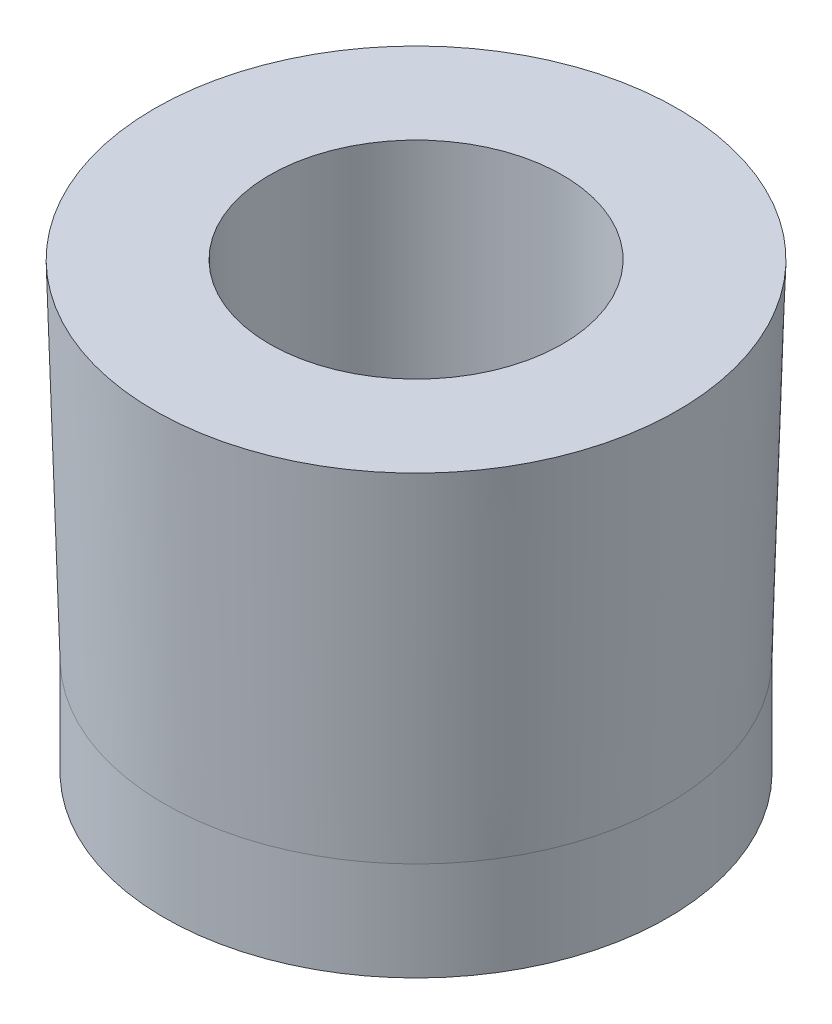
from build123d import *

# Parameters (mm, degrees)
F_4_40_TAPPED_HOLE1_D = 2.2606


with BuildPart() as part:
    # Sketch1 → Revolve1 (revolve)
    with BuildSketch(Plane.XY, mode=Mode.PRIVATE) as revolve1_sk:
        Polygon((0, -0.889), (2.0193, -0.889), (1.9431, -3.556), (1.9431, -4.318), (0, -4.318), align=None)
    revolve(revolve1_sk.sketch.rotate(Axis((0, 0, 0), (0, -1, 0)), 180), axis=Axis((0, 0, 0), (0, -1, 0)))

    # 4-40 Tapped Hole1 (through all)
    with Locations(Plane(origin=(0, -0.889, 0), x_dir=(-1, 0, 0), z_dir=(0, 1, 0))):
        with Locations((0, 0)):
            Hole(F_4_40_TAPPED_HOLE1_D / 2)


solid = part.part
